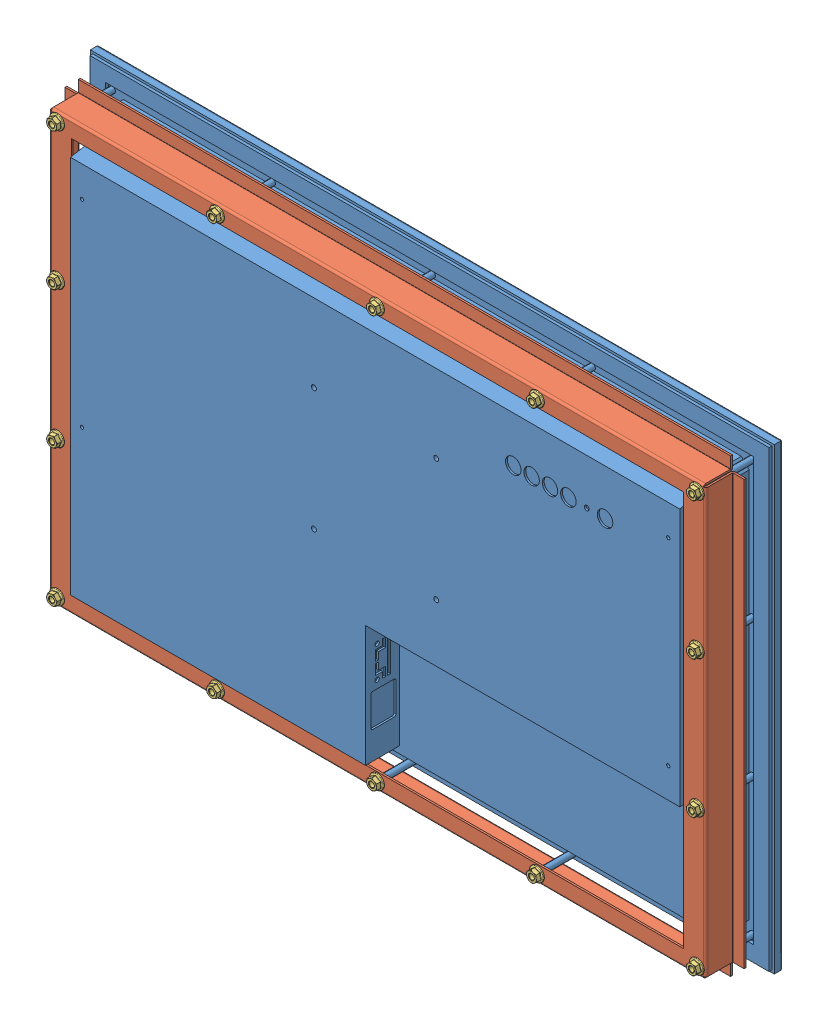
SolidWorks assembly 22 inch Panel Mount Monitor, HIS-ML22-xxxC.SLDASM, configuration Default (file format 10000). Lengths in mm.
Overall size (558.8 374.65 56.88).
16 component instances, 3 part files, 34 mates.
Components (placement in the parent):
- Monitor, 22C-2: Monitor, 22C.sldprt [Default] at origin size (558.8 374.65 53.87)
- Collar, 10767-1: Collar, 10767.sldprt [Default] at (0 0 43.2504) size (554.99 368.45 23.57)
- M5 Nut, 30008-1: M5 Nut, 30008.sldprt [M5 Nut - 30008] at (-261.4168 168.1226 49.7693) size (11.8 11.8 5)
- M5 Nut, 30008-2: M5 Nut, 30008.sldprt [M5 Nut - 30008] at (-130.7084 168.1226 49.7693) x (0.987351 0.158553 0) z (0 0 1) size (11.8 11.8 5)
- M5 Nut, 30008-4: M5 Nut, 30008.sldprt [M5 Nut - 30008] at (0 168.1226 49.7693) x (0.959125 0.282984 0) z (0 0 1) size (11.8 11.8 5)
- M5 Nut, 30008-6: M5 Nut, 30008.sldprt [M5 Nut - 30008] at (130.7084 168.1226 49.7693) x (0.928571 0.371154 0) z (0 0 1) size (11.8 11.8 5)
- M5 Nut, 30008-8: M5 Nut, 30008.sldprt [M5 Nut - 30008] at (261.4168 168.1226 49.7693) x (0.906989 0.421154 0) z (0 0 1) size (11.8 11.8 5)
- M5 Nut, 30008-10: M5 Nut, 30008.sldprt [M5 Nut - 30008] at (261.4168 56.0324 49.7693) x (0.902849 0.429957 0) z (0 0 1) size (11.8 11.8 5)
- M5 Nut, 30008-12: M5 Nut, 30008.sldprt [M5 Nut - 30008] at (261.4168 -56.0578 49.7693) x (0.919615 0.39282 0) z (0 0 1) size (11.8 11.8 5)
- M5 Nut, 30008-14: M5 Nut, 30008.sldprt [M5 Nut - 30008] at (261.4168 -168.1226 49.7693) x (0.952324 0.305088 0) z (0 0 1) size (11.8 11.8 5)
- M5 Nut, 30008-16: M5 Nut, 30008.sldprt [M5 Nut - 30008] at (130.7084 -168.1226 49.7693) x (0.985697 0.168526 0) z (0 0 1) size (11.8 11.8 5)
- M5 Nut, 30008-18: M5 Nut, 30008.sldprt [M5 Nut - 30008] at (0 -168.1226 49.7693) size (11.8 11.8 5)
- M5 Nut, 30008-20: M5 Nut, 30008.sldprt [M5 Nut - 30008] at (-130.7084 -168.1226 49.7693) x (0.985697 -0.168526 0) z (0 0 1) size (11.8 11.8 5)
- M5 Nut, 30008-23: M5 Nut, 30008.sldprt [M5 Nut - 30008] at (-261.4168 -168.1226 49.7693) x (0.952324 -0.305088 0) z (0 0 1) size (11.8 11.8 5)
- M5 Nut, 30008-25: M5 Nut, 30008.sldprt [M5 Nut - 30008] at (-261.4168 -56.0578 49.7693) x (0.919615 -0.39282 0) z (0 0 1) size (11.8 11.8 5)
- M5 Nut, 30008-27: M5 Nut, 30008.sldprt [M5 Nut - 30008] at (-261.4168 56.0324 49.7693) x (0.902849 -0.429957 0) z (0 0 1) size (11.8 11.8 5)
Mates (geometry in assembly coordinates):
- Concentric1: concentric anti-aligned: cylinder of Monitor, 22C-2 through (261.4168 168.1226 42.7) axis (0 0 -1) radius 2.5; cylinder of ? through (261.4168 168.1226 33.4495) axis (0 0 1) radius 3.175
- Parallel1: parallel anti-aligned: line of Monitor, 22C-2 through (558.8 279.4 187.325) axis (0 -1 0); line of ? through (-304.5188 184.2262 11.3972) axis (1 0 0)
- Concentric21: concentric aligned: cylinder of ? through (-299.5168 168.1226 33.4495) axis (0 0 1) radius 3.175; cylinder of M5 Nut, 30008-1 through (-299.5168 168.1226 13.412) axis (0 0 1) radius 2.5
- Coincident11: coincident anti-aligned: plane of ? through (-19.0246 0 33.4495) normal (0 0 1); plane of M5 Nut, 30008-1 through (-299.5168 172.7414 33.4495) normal (0 0 -1)
- Concentric22: concentric anti-aligned: cylinder of Monitor, 22C-2 through (261.4168 168.1226 42.7) axis (0 0 -1) radius 2.5; cylinder of Collar, 10767-1 through (261.4168 168.1226 44.7693) axis (0 0 1) radius 3.175
- Parallel2: parallel anti-aligned: line of Monitor, 22C-2 through (558.8 279.4 187.325) axis (0 -1 0); line of Collar, 10767-1 through (-266.4442 184.2262 21.1981) axis (1 0 0)
- Concentric23: concentric aligned: circle of Collar, 10767-1; cylinder of M5 Nut, 30008-1 through (-261.4168 168.1226 44.7693) axis (0 0 1) radius 2.1
- Coincident13: coincident anti-aligned: plane of Collar, 10767-1 through (0 0 44.7693) normal (0 0 1); plane of M5 Nut, 30008-1 through (-261.4168 172.7414 44.7693) normal (0 0 -1)
- Concentric24: concentric: circle of Collar, 10767-1; cylinder of M5 Nut, 30008-2 through (-130.7084 168.1226 146.0142) axis (0 0 1) radius 2.5
- Coincident27: coincident anti-aligned: plane of Collar, 10767-1 through (0 0 44.7693) normal (0 0 1); plane of M5 Nut, 30008-2 through (-131.4407 172.683 44.7693) normal (0 0 -1)
- Concentric25: concentric aligned: circle of Collar, 10767-1; cylinder of M5 Nut, 30008-4 through (0 168.1226 24.7318) axis (0 0 1) radius 2.5
- Coincident15: coincident anti-aligned: plane of Collar, 10767-1 through (0 0 44.7693) normal (0 0 1); plane of M5 Nut, 30008-4 through (-1.307 172.5526 44.7693) normal (0 0 -1)
- Concentric26: concentric aligned: circle of Collar, 10767-1; cylinder of M5 Nut, 30008-6 through (130.7084 168.1226 24.7318) axis (0 0 1) radius 2.5
- Coincident16: coincident anti-aligned: plane of Collar, 10767-1 through (0 0 44.7693) normal (0 0 1); plane of M5 Nut, 30008-6 through (128.9941 172.4115 44.7693) normal (0 0 -1)
- Concentric27: concentric aligned: circle of Collar, 10767-1; cylinder of M5 Nut, 30008-8 through (261.4168 168.1226 24.7318) axis (0 0 1) radius 2.5
- Coincident17: coincident anti-aligned: plane of Collar, 10767-1 through (0 0 44.7693) normal (0 0 1); plane of M5 Nut, 30008-8 through (259.4716 172.3118 44.7693) normal (0 0 -1)
- Concentric28: concentric aligned: circle of Collar, 10767-1; cylinder of M5 Nut, 30008-10 through (261.4168 56.0324 24.7318) axis (0 0 1) radius 2.5
- Coincident18: coincident anti-aligned: plane of Collar, 10767-1 through (0 0 44.7693) normal (0 0 1); plane of M5 Nut, 30008-10 through (259.4309 60.2025 44.7693) normal (0 0 -1)
- Concentric29: concentric aligned: circle of Collar, 10767-1; cylinder of M5 Nut, 30008-12 through (261.4168 -56.0578 24.7318) axis (0 0 1) radius 2.5
- Coincident19: coincident anti-aligned: plane of Collar, 10767-1 through (0 0 44.7693) normal (0 0 1); plane of M5 Nut, 30008-12 through (259.6024 -51.8103 44.7693) normal (0 0 -1)
- Concentric30: concentric aligned: circle of Collar, 10767-1; cylinder of M5 Nut, 30008-14 through (261.4168 -168.1226 24.7318) axis (0 0 1) radius 2.5
- Coincident20: coincident anti-aligned: plane of Collar, 10767-1 through (0 0 44.7693) normal (0 0 1); plane of M5 Nut, 30008-14 through (260.0077 -163.724 44.7693) normal (0 0 -1)
- Concentric31: concentric aligned: circle of Collar, 10767-1; cylinder of M5 Nut, 30008-16 through (130.7084 -168.1226 24.7318) axis (0 0 1) radius 2.5
- Coincident21: coincident anti-aligned: plane of Collar, 10767-1 through (0 0 44.7693) normal (0 0 1); plane of M5 Nut, 30008-16 through (129.93 -163.5699 44.7693) normal (0 0 -1)
- Concentric32: concentric aligned: circle of Collar, 10767-1; cylinder of M5 Nut, 30008-18 through (0 -168.1226 24.7318) axis (0 0 1) radius 2.5
- Coincident22: coincident anti-aligned: plane of Collar, 10767-1 through (0 0 44.7693) normal (0 0 1); plane of M5 Nut, 30008-18 through (0 -163.5038 44.7693) normal (0 0 -1)
- Concentric33: concentric aligned: circle of Collar, 10767-1; cylinder of M5 Nut, 30008-20 through (-130.7084 -168.1226 24.7318) axis (0 0 1) radius 2.5
- Coincident23: coincident anti-aligned: plane of Collar, 10767-1 through (0 0 44.7693) normal (0 0 1); plane of M5 Nut, 30008-20 through (-129.93 -163.5699 44.7693) normal (0 0 -1)
- Concentric35: concentric aligned: circle of Collar, 10767-1; cylinder of M5 Nut, 30008-23 through (-261.4168 -168.1226 24.7318) axis (0 0 1) radius 2.5
- Coincident24: coincident anti-aligned: plane of Collar, 10767-1 through (0 0 44.7693) normal (0 0 1); plane of M5 Nut, 30008-23 through (-260.0077 -163.724 44.7693) normal (0 0 -1)
- Concentric36: concentric aligned: circle of Collar, 10767-1; cylinder of M5 Nut, 30008-25 through (-261.4168 -56.0578 24.7318) axis (0 0 1) radius 2.5
- Coincident25: coincident anti-aligned: plane of Collar, 10767-1 through (0 0 44.7693) normal (0 0 1); plane of M5 Nut, 30008-25 through (-259.6024 -51.8103 44.7693) normal (0 0 -1)
- Concentric37: concentric aligned: circle of Collar, 10767-1; cylinder of M5 Nut, 30008-27 through (-261.4168 56.0324 24.7318) axis (0 0 1) radius 2.5
- Coincident26: coincident anti-aligned: plane of Collar, 10767-1 through (0 0 44.7693) normal (0 0 1); plane of M5 Nut, 30008-27 through (-259.4309 60.2025 44.7693) normal (0 0 -1)
